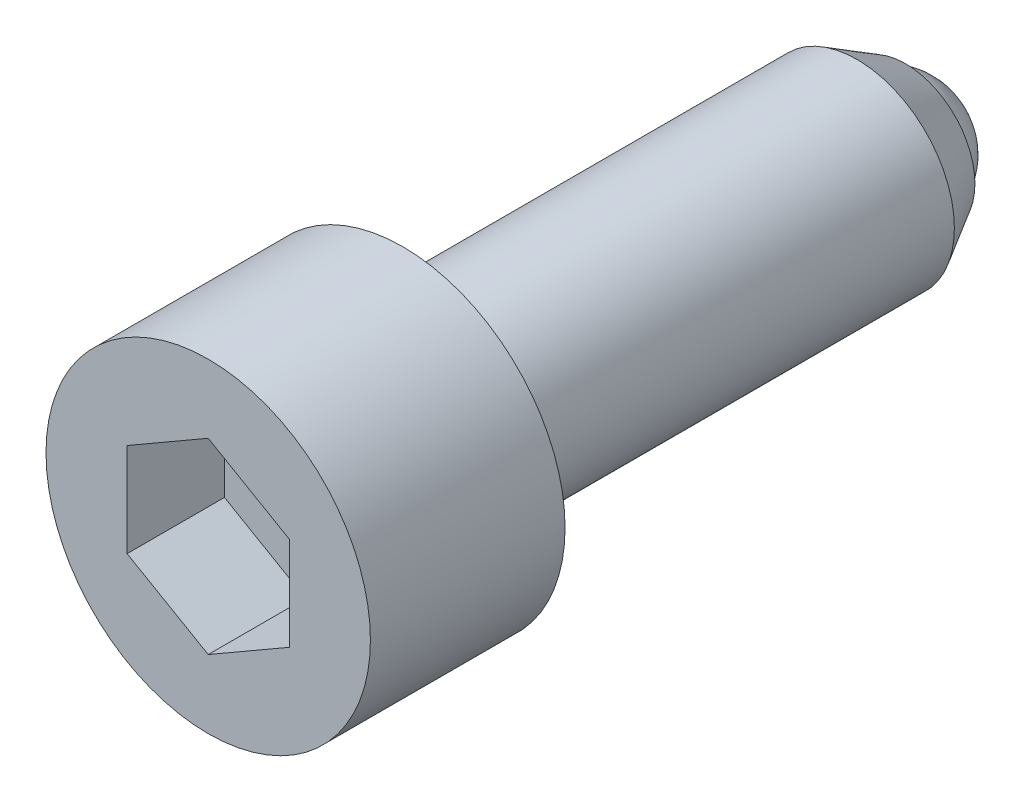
ISO-10303-21;
HEADER;
FILE_DESCRIPTION(('STEP AP214'),'2;1');
FILE_NAME('part.step','',(''),(''),'','','');
FILE_SCHEMA(('AUTOMOTIVE_DESIGN { 1 0 10303 214 1 1 1 1 }'));
ENDSEC;
DATA;
#1=APPLICATION_CONTEXT('core data for automotive mechanical design processes');
#2=APPLICATION_PROTOCOL_DEFINITION('international standard','automotive_design',2000,#1);
#3=PRODUCT_CONTEXT('',#1,'mechanical');
#4=PRODUCT('Part','Part','',(#3));
#5=PRODUCT_RELATED_PRODUCT_CATEGORY('part','',(#4));
#6=PRODUCT_DEFINITION_FORMATION('','',#4);
#7=PRODUCT_DEFINITION_CONTEXT('part definition',#1,'design');
#8=PRODUCT_DEFINITION('design','',#6,#7);
#9=PRODUCT_DEFINITION_SHAPE('','',#8);
#10=(LENGTH_UNIT() NAMED_UNIT(*) SI_UNIT(.MILLI.,.METRE.));
#11=(NAMED_UNIT(*) PLANE_ANGLE_UNIT() SI_UNIT($,.RADIAN.));
#12=(NAMED_UNIT(*) SI_UNIT($,.STERADIAN.) SOLID_ANGLE_UNIT());
#13=UNCERTAINTY_MEASURE_WITH_UNIT(LENGTH_MEASURE(1.E-05),#10,'distance_accuracy_value','');
#14=(GEOMETRIC_REPRESENTATION_CONTEXT(3) GLOBAL_UNCERTAINTY_ASSIGNED_CONTEXT((#13)) GLOBAL_UNIT_ASSIGNED_CONTEXT((#10,
#11,#12)) REPRESENTATION_CONTEXT('',''));
#15=CARTESIAN_POINT('',(0.,0.,0.));
#16=DIRECTION('',(0.,0.,1.));
#17=DIRECTION('',(1.,0.,0.));
#18=AXIS2_PLACEMENT_3D('',#15,#16,#17);
#19=CARTESIAN_POINT('',(0.,0.,2.));
#20=DIRECTION('',(0.,0.,-1.));
#21=DIRECTION('',(1.,0.,0.));
#22=AXIS2_PLACEMENT_3D('',#19,#20,#21);
#23=SPHERICAL_SURFACE('',#22,2.);
#24=CARTESIAN_POINT('',(0.,0.,1.4));
#25=DIRECTION('',(0.,0.,-1.));
#26=DIRECTION('',(1.,0.,0.));
#27=AXIS2_PLACEMENT_3D('',#24,#25,#26);
#28=CIRCLE('',#27,1.90787840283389);
#29=CARTESIAN_POINT('',(1.90787840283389,0.,1.4));
#30=VERTEX_POINT('',#29);
#31=EDGE_CURVE('E9',#30,#30,#28,.T.);
#32=ORIENTED_EDGE('',*,*,#31,.T.);
#33=EDGE_LOOP('',(#32));
#34=FACE_BOUND('',#33,.T.);
#35=ADVANCED_FACE('F14',(#34),#23,.T.);
#36=CARTESIAN_POINT('',(2.13397459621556,0.,1.4));
#37=DIRECTION('',(0.,0.,1.));
#38=DIRECTION('',(-1.,0.,0.));
#39=AXIS2_PLACEMENT_3D('',#36,#37,#38);
#40=PLANE('',#39);
#41=ORIENTED_EDGE('',*,*,#31,.F.);
#42=EDGE_LOOP('',(#41));
#43=FACE_BOUND('',#42,.T.);
#44=CARTESIAN_POINT('',(0.,0.,1.4));
#45=DIRECTION('',(0.,0.,-1.));
#46=DIRECTION('',(1.,0.,0.));
#47=AXIS2_PLACEMENT_3D('',#44,#45,#46);
#48=CIRCLE('',#47,2.13397459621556);
#49=CARTESIAN_POINT('',(2.13397459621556,0.,1.4));
#50=VERTEX_POINT('',#49);
#51=EDGE_CURVE('E21',#50,#50,#48,.T.);
#52=ORIENTED_EDGE('',*,*,#51,.T.);
#53=EDGE_LOOP('',(#52));
#54=FACE_BOUND('',#53,.T.);
#55=ADVANCED_FACE('F135',(#43,#54),#40,.F.);
#56=CARTESIAN_POINT('',(0.,0.,2.9));
#57=DIRECTION('',(0.,0.,1.));
#58=DIRECTION('',(-1.,0.,0.));
#59=AXIS2_PLACEMENT_3D('',#56,#57,#58);
#60=CONICAL_SURFACE('',#59,3.,0.523598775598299);
#61=ORIENTED_EDGE('',*,*,#51,.F.);
#62=EDGE_LOOP('',(#61));
#63=FACE_BOUND('',#62,.T.);
#64=CARTESIAN_POINT('',(0.,0.,2.9));
#65=DIRECTION('',(0.,0.,-1.));
#66=DIRECTION('',(1.,0.,0.));
#67=AXIS2_PLACEMENT_3D('',#64,#65,#66);
#68=CIRCLE('',#67,3.);
#69=CARTESIAN_POINT('',(3.,0.,2.9));
#70=VERTEX_POINT('',#69);
#71=EDGE_CURVE('E130',#70,#70,#68,.T.);
#72=ORIENTED_EDGE('',*,*,#71,.T.);
#73=EDGE_LOOP('',(#72));
#74=FACE_BOUND('',#73,.T.);
#75=ADVANCED_FACE('F137',(#63,#74),#60,.T.);
#76=CARTESIAN_POINT('',(0.,0.,-3.1));
#77=DIRECTION('',(0.,0.,-1.));
#78=DIRECTION('',(1.,0.,0.));
#79=AXIS2_PLACEMENT_3D('',#76,#77,#78);
#80=CYLINDRICAL_SURFACE('',#79,3.);
#81=ORIENTED_EDGE('',*,*,#71,.F.);
#82=EDGE_LOOP('',(#81));
#83=FACE_BOUND('',#82,.T.);
#84=CARTESIAN_POINT('',(0.,0.,16.9));
#85=DIRECTION('',(0.,0.,-1.));
#86=DIRECTION('',(1.,0.,0.));
#87=AXIS2_PLACEMENT_3D('',#84,#85,#86);
#88=CIRCLE('',#87,3.);
#89=CARTESIAN_POINT('',(3.,0.,16.9));
#90=VERTEX_POINT('',#89);
#91=EDGE_CURVE('E127',#90,#90,#88,.T.);
#92=ORIENTED_EDGE('',*,*,#91,.T.);
#93=EDGE_LOOP('',(#92));
#94=FACE_BOUND('',#93,.T.);
#95=ADVANCED_FACE('F140',(#83,#94),#80,.T.);
#96=CARTESIAN_POINT('',(3.,0.,16.9));
#97=DIRECTION('',(0.,0.,-1.));
#98=DIRECTION('',(1.,0.,0.));
#99=AXIS2_PLACEMENT_3D('',#96,#97,#98);
#100=PLANE('',#99);
#101=CARTESIAN_POINT('',(0.,0.,16.9));
#102=DIRECTION('',(0.,0.,-1.));
#103=DIRECTION('',(1.,0.,0.));
#104=AXIS2_PLACEMENT_3D('',#101,#102,#103);
#105=CIRCLE('',#104,5.);
#106=CARTESIAN_POINT('',(5.,0.,16.9));
#107=VERTEX_POINT('',#106);
#108=EDGE_CURVE('E124',#107,#107,#105,.T.);
#109=ORIENTED_EDGE('',*,*,#108,.T.);
#110=EDGE_LOOP('',(#109));
#111=FACE_BOUND('',#110,.T.);
#112=ORIENTED_EDGE('',*,*,#91,.F.);
#113=EDGE_LOOP('',(#112));
#114=FACE_BOUND('',#113,.T.);
#115=ADVANCED_FACE('F146',(#111,#114),#100,.T.);
#116=CARTESIAN_POINT('',(0.,0.,-3.1));
#117=DIRECTION('',(0.,0.,-1.));
#118=DIRECTION('',(1.,0.,0.));
#119=AXIS2_PLACEMENT_3D('',#116,#117,#118);
#120=CYLINDRICAL_SURFACE('',#119,5.);
#121=CARTESIAN_POINT('',(0.,0.,22.9));
#122=DIRECTION('',(0.,0.,-1.));
#123=DIRECTION('',(1.,0.,0.));
#124=AXIS2_PLACEMENT_3D('',#121,#122,#123);
#125=CIRCLE('',#124,5.);
#126=CARTESIAN_POINT('',(5.,0.,22.9));
#127=VERTEX_POINT('',#126);
#128=EDGE_CURVE('E121',#127,#127,#125,.T.);
#129=ORIENTED_EDGE('',*,*,#128,.T.);
#130=EDGE_LOOP('',(#129));
#131=FACE_BOUND('',#130,.T.);
#132=ORIENTED_EDGE('',*,*,#108,.F.);
#133=EDGE_LOOP('',(#132));
#134=FACE_BOUND('',#133,.T.);
#135=ADVANCED_FACE('F151',(#131,#134),#120,.T.);
#136=CARTESIAN_POINT('',(5.,0.,22.9));
#137=DIRECTION('',(0.,0.,1.));
#138=DIRECTION('',(-1.,0.,0.));
#139=AXIS2_PLACEMENT_3D('',#136,#137,#138);
#140=PLANE('',#139);
#141=DIRECTION('',(-0.86602540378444,0.5,0.));
#142=VECTOR('',#141,1.);
#143=CARTESIAN_POINT('',(2.5,1.44337567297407,22.9));
#144=LINE('',#143,#142);
#145=CARTESIAN_POINT('',(2.5,1.44337567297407,22.9));
#146=VERTEX_POINT('',#145);
#147=CARTESIAN_POINT('',(0.,2.88675134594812,22.9));
#148=VERTEX_POINT('',#147);
#149=EDGE_CURVE('E28',#146,#148,#144,.T.);
#150=ORIENTED_EDGE('',*,*,#149,.F.);
#151=DIRECTION('',(0.,1.,0.));
#152=VECTOR('',#151,1.);
#153=CARTESIAN_POINT('',(2.5,-1.44337567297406,22.9));
#154=LINE('',#153,#152);
#155=CARTESIAN_POINT('',(2.5,-1.44337567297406,22.9));
#156=VERTEX_POINT('',#155);
#157=EDGE_CURVE('E97',#156,#146,#154,.T.);
#158=ORIENTED_EDGE('',*,*,#157,.F.);
#159=DIRECTION('',(-0.866025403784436,-0.5,0.));
#160=VECTOR('',#159,1.);
#161=CARTESIAN_POINT('',(2.5,-1.44337567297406,22.9));
#162=LINE('',#161,#160);
#163=CARTESIAN_POINT('',(0.,-2.88675134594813,22.9));
#164=VERTEX_POINT('',#163);
#165=EDGE_CURVE('E92',#156,#164,#162,.T.);
#166=ORIENTED_EDGE('',*,*,#165,.T.);
#167=DIRECTION('',(0.866025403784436,-0.5,0.));
#168=VECTOR('',#167,1.);
#169=CARTESIAN_POINT('',(-2.5,-1.44337567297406,22.9));
#170=LINE('',#169,#168);
#171=CARTESIAN_POINT('',(-2.5,-1.44337567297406,22.9));
#172=VERTEX_POINT('',#171);
#173=EDGE_CURVE('E90',#172,#164,#170,.T.);
#174=ORIENTED_EDGE('',*,*,#173,.F.);
#175=DIRECTION('',(0.,1.,0.));
#176=VECTOR('',#175,1.);
#177=CARTESIAN_POINT('',(-2.5,-1.44337567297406,22.9));
#178=LINE('',#177,#176);
#179=CARTESIAN_POINT('',(-2.5,1.44337567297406,22.9));
#180=VERTEX_POINT('',#179);
#181=EDGE_CURVE('E71',#172,#180,#178,.T.);
#182=ORIENTED_EDGE('',*,*,#181,.T.);
#183=DIRECTION('',(0.866025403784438,0.5,0.));
#184=VECTOR('',#183,1.);
#185=CARTESIAN_POINT('',(-2.5,1.44337567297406,22.9));
#186=LINE('',#185,#184);
#187=EDGE_CURVE('E82',#180,#148,#186,.T.);
#188=ORIENTED_EDGE('',*,*,#187,.T.);
#189=EDGE_LOOP('',(#150,#158,#166,#174,#182,#188));
#190=FACE_BOUND('',#189,.T.);
#191=ORIENTED_EDGE('',*,*,#128,.F.);
#192=EDGE_LOOP('',(#191));
#193=FACE_BOUND('',#192,.T.);
#194=ADVANCED_FACE('F86',(#190,#193),#140,.T.);
#195=CARTESIAN_POINT('',(2.5,1.44337567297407,19.9));
#196=DIRECTION('',(0.5,0.86602540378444,0.));
#197=DIRECTION('',(0.86602540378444,-0.5,0.));
#198=AXIS2_PLACEMENT_3D('',#195,#196,#197);
#199=PLANE('',#198);
#200=DIRECTION('',(0.,0.,1.));
#201=VECTOR('',#200,1.);
#202=CARTESIAN_POINT('',(2.5,1.44337567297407,19.9));
#203=LINE('',#202,#201);
#204=CARTESIAN_POINT('',(2.5,1.44337567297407,19.9));
#205=VERTEX_POINT('',#204);
#206=EDGE_CURVE('E35',#205,#146,#203,.T.);
#207=ORIENTED_EDGE('',*,*,#206,.T.);
#208=ORIENTED_EDGE('',*,*,#149,.T.);
#209=DIRECTION('',(0.,0.,1.));
#210=VECTOR('',#209,1.);
#211=CARTESIAN_POINT('',(0.,2.88675134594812,19.9));
#212=LINE('',#211,#210);
#213=CARTESIAN_POINT('',(0.,2.88675134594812,19.9));
#214=VERTEX_POINT('',#213);
#215=EDGE_CURVE('E79',#214,#148,#212,.T.);
#216=ORIENTED_EDGE('',*,*,#215,.F.);
#217=DIRECTION('',(-0.86602540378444,0.5,0.));
#218=VECTOR('',#217,1.);
#219=CARTESIAN_POINT('',(2.5,1.44337567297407,19.9));
#220=LINE('',#219,#218);
#221=EDGE_CURVE('E99',#205,#214,#220,.T.);
#222=ORIENTED_EDGE('',*,*,#221,.F.);
#223=EDGE_LOOP('',(#207,#208,#216,#222));
#224=FACE_BOUND('',#223,.T.);
#225=ADVANCED_FACE('F205',(#224),#199,.F.);
#226=CARTESIAN_POINT('',(2.5,-1.44337567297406,19.9));
#227=DIRECTION('',(1.,0.,0.));
#228=DIRECTION('',(0.,0.,1.));
#229=AXIS2_PLACEMENT_3D('',#226,#227,#228);
#230=PLANE('',#229);
#231=DIRECTION('',(0.,0.,1.));
#232=VECTOR('',#231,1.);
#233=CARTESIAN_POINT('',(2.5,-1.44337567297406,19.9));
#234=LINE('',#233,#232);
#235=CARTESIAN_POINT('',(2.5,-1.44337567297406,19.9));
#236=VERTEX_POINT('',#235);
#237=EDGE_CURVE('E118',#236,#156,#234,.T.);
#238=ORIENTED_EDGE('',*,*,#237,.T.);
#239=ORIENTED_EDGE('',*,*,#157,.T.);
#240=ORIENTED_EDGE('',*,*,#206,.F.);
#241=DIRECTION('',(0.,1.,0.));
#242=VECTOR('',#241,1.);
#243=CARTESIAN_POINT('',(2.5,-1.44337567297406,19.9));
#244=LINE('',#243,#242);
#245=EDGE_CURVE('E111',#236,#205,#244,.T.);
#246=ORIENTED_EDGE('',*,*,#245,.F.);
#247=EDGE_LOOP('',(#238,#239,#240,#246));
#248=FACE_BOUND('',#247,.T.);
#249=ADVANCED_FACE('F214',(#248),#230,.F.);
#250=CARTESIAN_POINT('',(2.5,-1.44337567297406,19.9));
#251=DIRECTION('',(-0.5,0.866025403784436,0.));
#252=DIRECTION('',(0.866025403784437,0.5,0.));
#253=AXIS2_PLACEMENT_3D('',#250,#251,#252);
#254=PLANE('',#253);
#255=DIRECTION('',(0.,0.,1.));
#256=VECTOR('',#255,1.);
#257=CARTESIAN_POINT('',(0.,-2.88675134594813,19.9));
#258=LINE('',#257,#256);
#259=CARTESIAN_POINT('',(0.,-2.88675134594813,19.9));
#260=VERTEX_POINT('',#259);
#261=EDGE_CURVE('E116',#260,#164,#258,.T.);
#262=ORIENTED_EDGE('',*,*,#261,.T.);
#263=ORIENTED_EDGE('',*,*,#165,.F.);
#264=ORIENTED_EDGE('',*,*,#237,.F.);
#265=DIRECTION('',(-0.866025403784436,-0.5,0.));
#266=VECTOR('',#265,1.);
#267=CARTESIAN_POINT('',(2.5,-1.44337567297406,19.9));
#268=LINE('',#267,#266);
#269=EDGE_CURVE('E108',#236,#260,#268,.T.);
#270=ORIENTED_EDGE('',*,*,#269,.T.);
#271=EDGE_LOOP('',(#262,#263,#264,#270));
#272=FACE_BOUND('',#271,.T.);
#273=ADVANCED_FACE('F223',(#272),#254,.T.);
#274=CARTESIAN_POINT('',(-2.5,-1.44337567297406,19.9));
#275=DIRECTION('',(-0.5,-0.866025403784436,0.));
#276=DIRECTION('',(-0.866025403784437,0.5,0.));
#277=AXIS2_PLACEMENT_3D('',#274,#275,#276);
#278=PLANE('',#277);
#279=DIRECTION('',(0.,0.,1.));
#280=VECTOR('',#279,1.);
#281=CARTESIAN_POINT('',(-2.5,-1.44337567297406,19.9));
#282=LINE('',#281,#280);
#283=CARTESIAN_POINT('',(-2.5,-1.44337567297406,19.9));
#284=VERTEX_POINT('',#283);
#285=EDGE_CURVE('E78',#284,#172,#282,.T.);
#286=ORIENTED_EDGE('',*,*,#285,.T.);
#287=ORIENTED_EDGE('',*,*,#173,.T.);
#288=ORIENTED_EDGE('',*,*,#261,.F.);
#289=DIRECTION('',(0.866025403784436,-0.5,0.));
#290=VECTOR('',#289,1.);
#291=CARTESIAN_POINT('',(-2.5,-1.44337567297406,19.9));
#292=LINE('',#291,#290);
#293=EDGE_CURVE('E105',#284,#260,#292,.T.);
#294=ORIENTED_EDGE('',*,*,#293,.F.);
#295=EDGE_LOOP('',(#286,#287,#288,#294));
#296=FACE_BOUND('',#295,.T.);
#297=ADVANCED_FACE('F232',(#296),#278,.F.);
#298=CARTESIAN_POINT('',(-2.5,-1.44337567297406,19.9));
#299=DIRECTION('',(1.,0.,0.));
#300=DIRECTION('',(0.,-1.,0.));
#301=AXIS2_PLACEMENT_3D('',#298,#299,#300);
#302=PLANE('',#301);
#303=DIRECTION('',(0.,0.,1.));
#304=VECTOR('',#303,1.);
#305=CARTESIAN_POINT('',(-2.5,1.44337567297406,19.9));
#306=LINE('',#305,#304);
#307=CARTESIAN_POINT('',(-2.5,1.44337567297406,19.9));
#308=VERTEX_POINT('',#307);
#309=EDGE_CURVE('E67',#308,#180,#306,.T.);
#310=ORIENTED_EDGE('',*,*,#309,.T.);
#311=ORIENTED_EDGE('',*,*,#181,.F.);
#312=ORIENTED_EDGE('',*,*,#285,.F.);
#313=DIRECTION('',(0.,1.,0.));
#314=VECTOR('',#313,1.);
#315=CARTESIAN_POINT('',(-2.5,-1.44337567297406,19.9));
#316=LINE('',#315,#314);
#317=EDGE_CURVE('E74',#284,#308,#316,.T.);
#318=ORIENTED_EDGE('',*,*,#317,.T.);
#319=EDGE_LOOP('',(#310,#311,#312,#318));
#320=FACE_BOUND('',#319,.T.);
#321=ADVANCED_FACE('F69',(#320),#302,.T.);
#322=CARTESIAN_POINT('',(-2.5,1.44337567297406,19.9));
#323=DIRECTION('',(0.5,-0.866025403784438,0.));
#324=DIRECTION('',(-0.866025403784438,-0.5,0.));
#325=AXIS2_PLACEMENT_3D('',#322,#323,#324);
#326=PLANE('',#325);
#327=DIRECTION('',(0.866025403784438,0.5,0.));
#328=VECTOR('',#327,1.);
#329=CARTESIAN_POINT('',(-2.5,1.44337567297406,19.9));
#330=LINE('',#329,#328);
#331=EDGE_CURVE('E102',#308,#214,#330,.T.);
#332=ORIENTED_EDGE('',*,*,#331,.T.);
#333=ORIENTED_EDGE('',*,*,#215,.T.);
#334=ORIENTED_EDGE('',*,*,#187,.F.);
#335=ORIENTED_EDGE('',*,*,#309,.F.);
#336=EDGE_LOOP('',(#332,#333,#334,#335));
#337=FACE_BOUND('',#336,.T.);
#338=ADVANCED_FACE('F83',(#337),#326,.T.);
#339=CARTESIAN_POINT('',(2.5,1.44337567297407,19.9));
#340=DIRECTION('',(0.,0.,-1.));
#341=DIRECTION('',(1.,0.,0.));
#342=AXIS2_PLACEMENT_3D('',#339,#340,#341);
#343=PLANE('',#342);
#344=ORIENTED_EDGE('',*,*,#221,.T.);
#345=ORIENTED_EDGE('',*,*,#331,.F.);
#346=ORIENTED_EDGE('',*,*,#317,.F.);
#347=ORIENTED_EDGE('',*,*,#293,.T.);
#348=ORIENTED_EDGE('',*,*,#269,.F.);
#349=ORIENTED_EDGE('',*,*,#245,.T.);
#350=EDGE_LOOP('',(#344,#345,#346,#347,#348,#349));
#351=FACE_BOUND('',#350,.T.);
#352=ADVANCED_FACE('F252',(#351),#343,.F.);
#353=CLOSED_SHELL('',(#35,#55,#75,#95,#115,#135,#194,#225,#249,#273,#297,#321,#338,#352));
#354=MANIFOLD_SOLID_BREP('B1',#353);
#355=ADVANCED_BREP_SHAPE_REPRESENTATION('',(#18,#354),#14);
#356=SHAPE_DEFINITION_REPRESENTATION(#9,#355);
ENDSEC;
END-ISO-10303-21;
